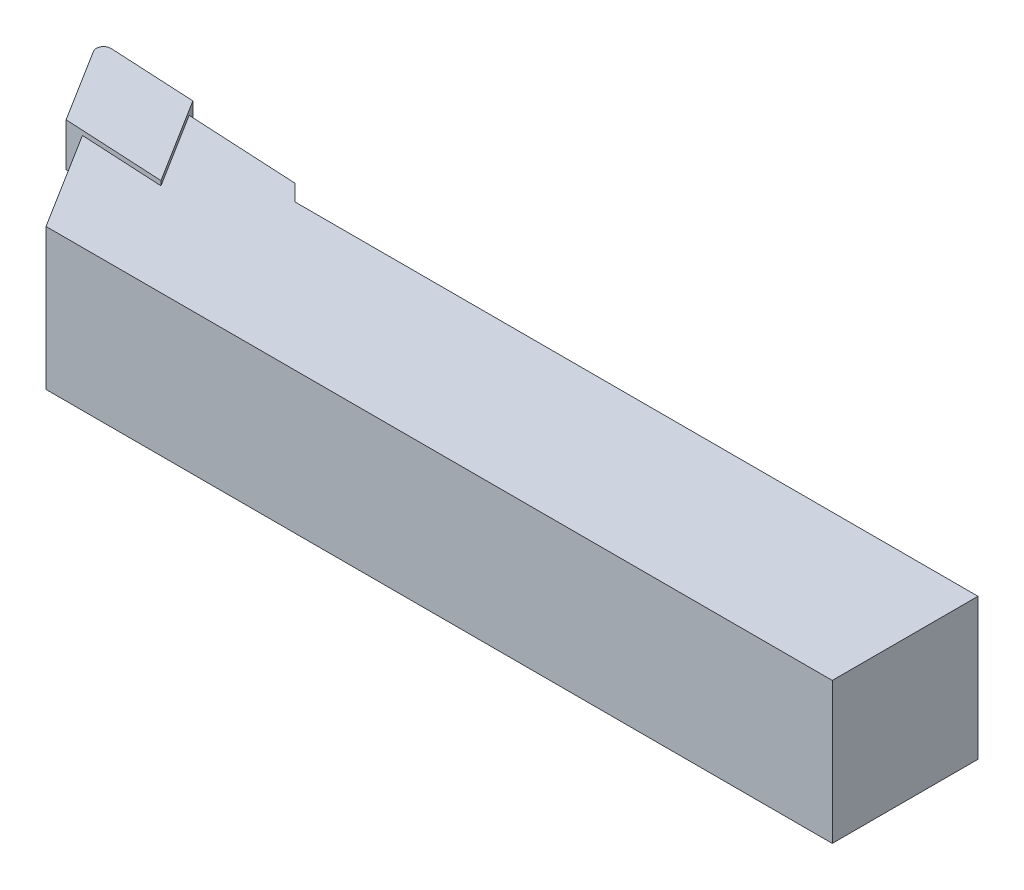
ISO-10303-21;
HEADER;
FILE_DESCRIPTION(('STEP AP214'),'2;1');
FILE_NAME('part.step','',(''),(''),'','','');
FILE_SCHEMA(('AUTOMOTIVE_DESIGN { 1 0 10303 214 1 1 1 1 }'));
ENDSEC;
DATA;
#1=APPLICATION_CONTEXT('core data for automotive mechanical design processes');
#2=APPLICATION_PROTOCOL_DEFINITION('international standard','automotive_design',2000,#1);
#3=PRODUCT_CONTEXT('',#1,'mechanical');
#4=PRODUCT('Part','Part','',(#3));
#5=PRODUCT_RELATED_PRODUCT_CATEGORY('part','',(#4));
#6=PRODUCT_DEFINITION_FORMATION('','',#4);
#7=PRODUCT_DEFINITION_CONTEXT('part definition',#1,'design');
#8=PRODUCT_DEFINITION('design','',#6,#7);
#9=PRODUCT_DEFINITION_SHAPE('','',#8);
#10=(LENGTH_UNIT() NAMED_UNIT(*) SI_UNIT(.MILLI.,.METRE.));
#11=(NAMED_UNIT(*) PLANE_ANGLE_UNIT() SI_UNIT($,.RADIAN.));
#12=(NAMED_UNIT(*) SI_UNIT($,.STERADIAN.) SOLID_ANGLE_UNIT());
#13=UNCERTAINTY_MEASURE_WITH_UNIT(LENGTH_MEASURE(1.E-05),#10,'distance_accuracy_value','');
#14=(GEOMETRIC_REPRESENTATION_CONTEXT(3) GLOBAL_UNCERTAINTY_ASSIGNED_CONTEXT((#13)) GLOBAL_UNIT_ASSIGNED_CONTEXT((#10,
#11,#12)) REPRESENTATION_CONTEXT('',''));
#15=CARTESIAN_POINT('',(0.,0.,0.));
#16=DIRECTION('',(0.,0.,1.));
#17=DIRECTION('',(1.,0.,0.));
#18=AXIS2_PLACEMENT_3D('',#15,#16,#17);
#19=CARTESIAN_POINT('',(5.13630108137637,-4.76,9.2491962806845));
#20=DIRECTION('',(-0.0523359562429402,0.,0.998629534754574));
#21=DIRECTION('',(0.998629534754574,0.,0.0523359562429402));
#22=AXIS2_PLACEMENT_3D('',#19,#20,#21);
#23=PLANE('',#22);
#24=DIRECTION('',(0.,-1.,0.));
#25=VECTOR('',#24,1.);
#26=CARTESIAN_POINT('',(7.02041880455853,-4.76,9.34793870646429));
#27=LINE('',#26,#25);
#28=CARTESIAN_POINT('',(7.02041880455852,-0.5,9.34793870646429));
#29=VERTEX_POINT('',#28);
#30=CARTESIAN_POINT('',(7.02041880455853,-4.76,9.34793870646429));
#31=VERTEX_POINT('',#30);
#32=EDGE_CURVE('E192',#29,#31,#27,.T.);
#33=ORIENTED_EDGE('',*,*,#32,.F.);
#34=DIRECTION('',(-0.998629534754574,0.,-0.0523359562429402));
#35=VECTOR('',#34,1.);
#36=CARTESIAN_POINT('',(5.13630108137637,-0.5,9.2491962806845));
#37=LINE('',#36,#35);
#38=CARTESIAN_POINT('',(16.1212259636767,-0.5,9.82489179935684));
#39=VERTEX_POINT('',#38);
#40=EDGE_CURVE('E194',#39,#29,#37,.T.);
#41=ORIENTED_EDGE('',*,*,#40,.F.);
#42=DIRECTION('',(0.,1.,0.));
#43=VECTOR('',#42,1.);
#44=CARTESIAN_POINT('',(16.1212259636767,-4.76,9.82489179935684));
#45=LINE('',#44,#43);
#46=CARTESIAN_POINT('',(16.1212259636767,0.,9.82489179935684));
#47=VERTEX_POINT('',#46);
#48=EDGE_CURVE('E209',#39,#47,#45,.T.);
#49=ORIENTED_EDGE('',*,*,#48,.T.);
#50=DIRECTION('',(0.998629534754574,0.,0.0523359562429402));
#51=VECTOR('',#50,1.);
#52=CARTESIAN_POINT('',(5.13630108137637,0.,9.2491962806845));
#53=LINE('',#52,#51);
#54=CARTESIAN_POINT('',(5.13630108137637,0.,9.2491962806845));
#55=VERTEX_POINT('',#54);
#56=EDGE_CURVE('E196',#55,#47,#53,.T.);
#57=ORIENTED_EDGE('',*,*,#56,.F.);
#58=DIRECTION('',(0.,1.,0.));
#59=VECTOR('',#58,1.);
#60=CARTESIAN_POINT('',(5.13630108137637,-4.76,9.2491962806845));
#61=LINE('',#60,#59);
#62=CARTESIAN_POINT('',(5.13630108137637,-4.76,9.2491962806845));
#63=VERTEX_POINT('',#62);
#64=EDGE_CURVE('E54',#63,#55,#61,.T.);
#65=ORIENTED_EDGE('',*,*,#64,.F.);
#66=DIRECTION('',(0.998629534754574,0.,0.0523359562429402));
#67=VECTOR('',#66,1.);
#68=CARTESIAN_POINT('',(5.13630108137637,-4.76,9.2491962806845));
#69=LINE('',#68,#67);
#70=EDGE_CURVE('E197',#63,#31,#69,.T.);
#71=ORIENTED_EDGE('',*,*,#70,.T.);
#72=EDGE_LOOP('',(#33,#41,#49,#57,#65,#71));
#73=FACE_BOUND('',#72,.T.);
#74=ADVANCED_FACE('F31',(#73),#23,.T.);
#75=CARTESIAN_POINT('',(0.12156152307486,-4.76,1.22393541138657));
#76=DIRECTION('',(-0.848048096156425,0.,0.529919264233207));
#77=DIRECTION('',(0.529919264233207,0.,0.848048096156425));
#78=AXIS2_PLACEMENT_3D('',#75,#76,#77);
#79=PLANE('',#78);
#80=DIRECTION('',(0.529919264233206,0.,0.848048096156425));
#81=VECTOR('',#80,1.);
#82=CARTESIAN_POINT('',(0.12156152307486,0.,1.22393541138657));
#83=LINE('',#82,#81);
#84=CARTESIAN_POINT('',(0.12156152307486,0.,1.22393541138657));
#85=VERTEX_POINT('',#84);
#86=EDGE_CURVE('E199',#85,#55,#83,.T.);
#87=ORIENTED_EDGE('',*,*,#86,.F.);
#88=DIRECTION('',(0.,1.,0.));
#89=VECTOR('',#88,1.);
#90=CARTESIAN_POINT('',(0.12156152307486,-4.76,1.22393541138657));
#91=LINE('',#90,#89);
#92=CARTESIAN_POINT('',(0.12156152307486,-4.76,1.22393541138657));
#93=VERTEX_POINT('',#92);
#94=EDGE_CURVE('E225',#93,#85,#91,.T.);
#95=ORIENTED_EDGE('',*,*,#94,.F.);
#96=DIRECTION('',(0.529919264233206,0.,0.848048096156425));
#97=VECTOR('',#96,1.);
#98=CARTESIAN_POINT('',(0.12156152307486,-4.76,1.22393541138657));
#99=LINE('',#98,#97);
#100=EDGE_CURVE('E207',#93,#63,#99,.T.);
#101=ORIENTED_EDGE('',*,*,#100,.T.);
#102=ORIENTED_EDGE('',*,*,#64,.T.);
#103=EDGE_LOOP('',(#87,#95,#101,#102));
#104=FACE_BOUND('',#103,.T.);
#105=ADVANCED_FACE('F254',(#104),#79,.T.);
#106=CARTESIAN_POINT('',(0.8,-4.76,0.8));
#107=DIRECTION('',(0.,1.,0.));
#108=DIRECTION('',(0.,0.,1.));
#109=AXIS2_PLACEMENT_3D('',#106,#107,#108);
#110=CYLINDRICAL_SURFACE('',#109,0.8);
#111=CARTESIAN_POINT('',(0.8,0.,0.8));
#112=DIRECTION('',(0.,1.,0.));
#113=DIRECTION('',(0.,0.,1.));
#114=AXIS2_PLACEMENT_3D('',#111,#112,#113);
#115=CIRCLE('',#114,0.8);
#116=CARTESIAN_POINT('',(0.841868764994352,0.,0.00109637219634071));
#117=VERTEX_POINT('',#116);
#118=EDGE_CURVE('E218',#117,#85,#115,.T.);
#119=ORIENTED_EDGE('',*,*,#118,.F.);
#120=DIRECTION('',(0.,1.,0.));
#121=VECTOR('',#120,1.);
#122=CARTESIAN_POINT('',(0.841868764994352,-4.76,0.00109637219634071));
#123=LINE('',#122,#121);
#124=CARTESIAN_POINT('',(0.841868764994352,-4.76,0.00109637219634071));
#125=VERTEX_POINT('',#124);
#126=EDGE_CURVE('E227',#125,#117,#123,.T.);
#127=ORIENTED_EDGE('',*,*,#126,.F.);
#128=CARTESIAN_POINT('',(0.8,-4.76,0.8));
#129=DIRECTION('',(0.,1.,0.));
#130=DIRECTION('',(0.,0.,1.));
#131=AXIS2_PLACEMENT_3D('',#128,#129,#130);
#132=CIRCLE('',#131,0.8);
#133=EDGE_CURVE('E204',#125,#93,#132,.T.);
#134=ORIENTED_EDGE('',*,*,#133,.T.);
#135=ORIENTED_EDGE('',*,*,#94,.T.);
#136=EDGE_LOOP('',(#119,#127,#134,#135));
#137=FACE_BOUND('',#136,.T.);
#138=ADVANCED_FACE('F257',(#137),#110,.T.);
#139=CARTESIAN_POINT('',(0.841868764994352,-4.76,0.0010963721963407));
#140=DIRECTION('',(0.0523359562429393,0.,-0.998629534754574));
#141=DIRECTION('',(-0.998629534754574,0.,-0.0523359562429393));
#142=AXIS2_PLACEMENT_3D('',#139,#140,#141);
#143=PLANE('',#142);
#144=DIRECTION('',(-0.998629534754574,0.,-0.0523359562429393));
#145=VECTOR('',#144,1.);
#146=CARTESIAN_POINT('',(0.841868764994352,0.,0.0010963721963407));
#147=LINE('',#146,#145);
#148=CARTESIAN_POINT('',(10.2921140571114,0.,0.496362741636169));
#149=VERTEX_POINT('',#148);
#150=EDGE_CURVE('E215',#149,#117,#147,.T.);
#151=ORIENTED_EDGE('',*,*,#150,.F.);
#152=DIRECTION('',(0.,1.,0.));
#153=VECTOR('',#152,1.);
#154=CARTESIAN_POINT('',(10.2921140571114,-4.76,0.496362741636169));
#155=LINE('',#154,#153);
#156=CARTESIAN_POINT('',(10.2921140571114,-4.76,0.496362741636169));
#157=VERTEX_POINT('',#156);
#158=EDGE_CURVE('E229',#157,#149,#155,.T.);
#159=ORIENTED_EDGE('',*,*,#158,.F.);
#160=DIRECTION('',(-0.998629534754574,0.,-0.0523359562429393));
#161=VECTOR('',#160,1.);
#162=CARTESIAN_POINT('',(0.841868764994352,-4.76,0.0010963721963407));
#163=LINE('',#162,#161);
#164=EDGE_CURVE('E201',#157,#125,#163,.T.);
#165=ORIENTED_EDGE('',*,*,#164,.T.);
#166=ORIENTED_EDGE('',*,*,#126,.T.);
#167=EDGE_LOOP('',(#151,#159,#165,#166));
#168=FACE_BOUND('',#167,.T.);
#169=ADVANCED_FACE('F261',(#168),#143,.T.);
#170=CARTESIAN_POINT('',(10.2921140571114,-4.76,0.496362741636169));
#171=DIRECTION('',(0.848048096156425,0.,-0.529919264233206));
#172=DIRECTION('',(-0.529919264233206,0.,-0.848048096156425));
#173=AXIS2_PLACEMENT_3D('',#170,#171,#172);
#174=PLANE('',#173);
#175=DIRECTION('',(0.,1.,0.));
#176=VECTOR('',#175,1.);
#177=CARTESIAN_POINT('',(10.9668206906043,-4.76,1.5761190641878));
#178=LINE('',#177,#176);
#179=CARTESIAN_POINT('',(10.9668206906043,-4.76,1.5761190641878));
#180=VERTEX_POINT('',#179);
#181=CARTESIAN_POINT('',(10.9668206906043,-0.5,1.5761190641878));
#182=VERTEX_POINT('',#181);
#183=EDGE_CURVE('E183',#180,#182,#178,.T.);
#184=ORIENTED_EDGE('',*,*,#183,.F.);
#185=DIRECTION('',(-0.529919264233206,0.,-0.848048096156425));
#186=VECTOR('',#185,1.);
#187=CARTESIAN_POINT('',(10.2921140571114,-4.76,0.496362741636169));
#188=LINE('',#187,#186);
#189=EDGE_CURVE('E83',#180,#157,#188,.T.);
#190=ORIENTED_EDGE('',*,*,#189,.T.);
#191=ORIENTED_EDGE('',*,*,#158,.T.);
#192=DIRECTION('',(-0.529919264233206,0.,-0.848048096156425));
#193=VECTOR('',#192,1.);
#194=CARTESIAN_POINT('',(10.2921140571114,0.,0.496362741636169));
#195=LINE('',#194,#193);
#196=EDGE_CURVE('E212',#47,#149,#195,.T.);
#197=ORIENTED_EDGE('',*,*,#196,.F.);
#198=ORIENTED_EDGE('',*,*,#48,.F.);
#199=DIRECTION('',(0.529919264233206,0.,0.848048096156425));
#200=VECTOR('',#199,1.);
#201=CARTESIAN_POINT('',(10.2921140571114,-0.5,0.496362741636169));
#202=LINE('',#201,#200);
#203=EDGE_CURVE('E11',#182,#39,#202,.T.);
#204=ORIENTED_EDGE('',*,*,#203,.F.);
#205=EDGE_LOOP('',(#184,#190,#191,#197,#198,#204));
#206=FACE_BOUND('',#205,.T.);
#207=ADVANCED_FACE('F249',(#206),#174,.T.);
#208=CARTESIAN_POINT('',(0.8,-4.76,0.8));
#209=DIRECTION('',(0.,1.,0.));
#210=DIRECTION('',(0.,0.,1.));
#211=AXIS2_PLACEMENT_3D('',#208,#209,#210);
#212=PLANE('',#211);
#213=DIRECTION('',(-0.998629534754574,0.,-0.0523359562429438));
#214=VECTOR('',#213,1.);
#215=CARTESIAN_POINT('',(0.787284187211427,-4.76,1.04263216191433));
#216=LINE('',#215,#214);
#217=CARTESIAN_POINT('',(1.86601353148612,-4.76,1.09916597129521));
#218=VERTEX_POINT('',#217);
#219=EDGE_CURVE('E224',#180,#218,#216,.T.);
#220=ORIENTED_EDGE('',*,*,#219,.T.);
#221=DIRECTION('',(0.529919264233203,0.,0.848048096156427));
#222=VECTOR('',#221,1.);
#223=CARTESIAN_POINT('',(1.43221725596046,-4.76,0.404946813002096));
#224=LINE('',#223,#222);
#225=EDGE_CURVE('E38',#218,#31,#224,.T.);
#226=ORIENTED_EDGE('',*,*,#225,.T.);
#227=ORIENTED_EDGE('',*,*,#70,.F.);
#228=ORIENTED_EDGE('',*,*,#100,.F.);
#229=ORIENTED_EDGE('',*,*,#133,.F.);
#230=ORIENTED_EDGE('',*,*,#164,.F.);
#231=ORIENTED_EDGE('',*,*,#189,.F.);
#232=EDGE_LOOP('',(#220,#226,#227,#228,#229,#230,#231));
#233=FACE_BOUND('',#232,.T.);
#234=ADVANCED_FACE('F235',(#233),#212,.F.);
#235=CARTESIAN_POINT('',(0.8,0.,0.8));
#236=DIRECTION('',(0.,1.,0.));
#237=DIRECTION('',(0.,0.,1.));
#238=AXIS2_PLACEMENT_3D('',#235,#236,#237);
#239=PLANE('',#238);
#240=ORIENTED_EDGE('',*,*,#56,.T.);
#241=ORIENTED_EDGE('',*,*,#196,.T.);
#242=ORIENTED_EDGE('',*,*,#150,.T.);
#243=ORIENTED_EDGE('',*,*,#118,.T.);
#244=ORIENTED_EDGE('',*,*,#86,.T.);
#245=EDGE_LOOP('',(#240,#241,#242,#243,#244));
#246=FACE_BOUND('',#245,.T.);
#247=ADVANCED_FACE('F252',(#246),#239,.T.);
#248=CARTESIAN_POINT('',(100.,-16.,4.));
#249=DIRECTION('',(0.,0.,-1.));
#250=DIRECTION('',(-1.,0.,0.));
#251=AXIS2_PLACEMENT_3D('',#248,#249,#250);
#252=PLANE('',#251);
#253=DIRECTION('',(-1.,0.,0.));
#254=VECTOR('',#253,1.);
#255=CARTESIAN_POINT('',(100.,-0.5,4.));
#256=LINE('',#255,#254);
#257=CARTESIAN_POINT('',(100.,-0.5,4.));
#258=VERTEX_POINT('',#257);
#259=CARTESIAN_POINT('',(25.,-0.5,4.));
#260=VERTEX_POINT('',#259);
#261=EDGE_CURVE('E172',#258,#260,#256,.T.);
#262=ORIENTED_EDGE('',*,*,#261,.F.);
#263=DIRECTION('',(0.,1.,0.));
#264=VECTOR('',#263,1.);
#265=CARTESIAN_POINT('',(100.,-16.,4.));
#266=LINE('',#265,#264);
#267=CARTESIAN_POINT('',(100.,-16.,4.));
#268=VERTEX_POINT('',#267);
#269=EDGE_CURVE('E157',#268,#258,#266,.T.);
#270=ORIENTED_EDGE('',*,*,#269,.F.);
#271=DIRECTION('',(-1.,0.,0.));
#272=VECTOR('',#271,1.);
#273=CARTESIAN_POINT('',(100.,-16.,4.));
#274=LINE('',#273,#272);
#275=CARTESIAN_POINT('',(25.,-16.,4.));
#276=VERTEX_POINT('',#275);
#277=EDGE_CURVE('E151',#268,#276,#274,.T.);
#278=ORIENTED_EDGE('',*,*,#277,.T.);
#279=DIRECTION('',(0.,1.,0.));
#280=VECTOR('',#279,1.);
#281=CARTESIAN_POINT('',(25.,-16.,4.));
#282=LINE('',#281,#280);
#283=EDGE_CURVE('E133',#276,#260,#282,.T.);
#284=ORIENTED_EDGE('',*,*,#283,.T.);
#285=EDGE_LOOP('',(#262,#270,#278,#284));
#286=FACE_BOUND('',#285,.T.);
#287=ADVANCED_FACE('F156',(#286),#252,.T.);
#288=CARTESIAN_POINT('',(100.,-16.,4.));
#289=DIRECTION('',(1.,0.,0.));
#290=DIRECTION('',(0.,0.,-1.));
#291=AXIS2_PLACEMENT_3D('',#288,#289,#290);
#292=PLANE('',#291);
#293=DIRECTION('',(0.,0.,-1.));
#294=VECTOR('',#293,1.);
#295=CARTESIAN_POINT('',(100.,-0.5,4.));
#296=LINE('',#295,#294);
#297=CARTESIAN_POINT('',(100.,-0.5,20.));
#298=VERTEX_POINT('',#297);
#299=EDGE_CURVE('E158',#298,#258,#296,.T.);
#300=ORIENTED_EDGE('',*,*,#299,.F.);
#301=DIRECTION('',(0.,1.,0.));
#302=VECTOR('',#301,1.);
#303=CARTESIAN_POINT('',(100.,-16.,20.));
#304=LINE('',#303,#302);
#305=CARTESIAN_POINT('',(100.,-16.,20.));
#306=VERTEX_POINT('',#305);
#307=EDGE_CURVE('E184',#306,#298,#304,.T.);
#308=ORIENTED_EDGE('',*,*,#307,.F.);
#309=DIRECTION('',(0.,0.,-1.));
#310=VECTOR('',#309,1.);
#311=CARTESIAN_POINT('',(100.,-16.,4.));
#312=LINE('',#311,#310);
#313=EDGE_CURVE('E144',#306,#268,#312,.T.);
#314=ORIENTED_EDGE('',*,*,#313,.T.);
#315=ORIENTED_EDGE('',*,*,#269,.T.);
#316=EDGE_LOOP('',(#300,#308,#314,#315));
#317=FACE_BOUND('',#316,.T.);
#318=ADVANCED_FACE('F283',(#317),#292,.T.);
#319=CARTESIAN_POINT('',(100.,-16.,20.));
#320=DIRECTION('',(0.,0.,1.));
#321=DIRECTION('',(1.,0.,0.));
#322=AXIS2_PLACEMENT_3D('',#319,#320,#321);
#323=PLANE('',#322);
#324=DIRECTION('',(1.,0.,0.));
#325=VECTOR('',#324,1.);
#326=CARTESIAN_POINT('',(100.,-0.5,20.));
#327=LINE('',#326,#325);
#328=CARTESIAN_POINT('',(13.6765654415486,-0.5,20.));
#329=VERTEX_POINT('',#328);
#330=EDGE_CURVE('E161',#329,#298,#327,.T.);
#331=ORIENTED_EDGE('',*,*,#330,.F.);
#332=DIRECTION('',(0.,1.,0.));
#333=VECTOR('',#332,1.);
#334=CARTESIAN_POINT('',(13.6765654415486,-16.,20.));
#335=LINE('',#334,#333);
#336=CARTESIAN_POINT('',(13.6765654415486,-16.,20.));
#337=VERTEX_POINT('',#336);
#338=EDGE_CURVE('E186',#337,#329,#335,.T.);
#339=ORIENTED_EDGE('',*,*,#338,.F.);
#340=DIRECTION('',(1.,0.,0.));
#341=VECTOR('',#340,1.);
#342=CARTESIAN_POINT('',(100.,-16.,20.));
#343=LINE('',#342,#341);
#344=EDGE_CURVE('E168',#337,#306,#343,.T.);
#345=ORIENTED_EDGE('',*,*,#344,.T.);
#346=ORIENTED_EDGE('',*,*,#307,.T.);
#347=EDGE_LOOP('',(#331,#339,#345,#346));
#348=FACE_BOUND('',#347,.T.);
#349=ADVANCED_FACE('F291',(#348),#323,.T.);
#350=CARTESIAN_POINT('',(1.86601353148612,-16.,1.09916597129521));
#351=DIRECTION('',(-0.848048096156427,0.,0.529919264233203));
#352=DIRECTION('',(0.529919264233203,0.,0.848048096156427));
#353=AXIS2_PLACEMENT_3D('',#350,#351,#352);
#354=PLANE('',#353);
#355=DIRECTION('',(0.529919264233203,0.,0.848048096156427));
#356=VECTOR('',#355,1.);
#357=CARTESIAN_POINT('',(1.86601353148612,-0.5,1.09916597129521));
#358=LINE('',#357,#356);
#359=EDGE_CURVE('E178',#29,#329,#358,.T.);
#360=ORIENTED_EDGE('',*,*,#359,.F.);
#361=ORIENTED_EDGE('',*,*,#32,.T.);
#362=ORIENTED_EDGE('',*,*,#225,.F.);
#363=DIRECTION('',(0.,1.,0.));
#364=VECTOR('',#363,1.);
#365=CARTESIAN_POINT('',(1.86601353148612,-16.,1.09916597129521));
#366=LINE('',#365,#364);
#367=CARTESIAN_POINT('',(1.86601353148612,-16.,1.09916597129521));
#368=VERTEX_POINT('',#367);
#369=EDGE_CURVE('E45',#368,#218,#366,.T.);
#370=ORIENTED_EDGE('',*,*,#369,.F.);
#371=DIRECTION('',(0.529919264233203,0.,0.848048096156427));
#372=VECTOR('',#371,1.);
#373=CARTESIAN_POINT('',(1.86601353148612,-16.,1.09916597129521));
#374=LINE('',#373,#372);
#375=EDGE_CURVE('E165',#368,#337,#374,.T.);
#376=ORIENTED_EDGE('',*,*,#375,.T.);
#377=ORIENTED_EDGE('',*,*,#338,.T.);
#378=EDGE_LOOP('',(#360,#361,#362,#370,#376,#377));
#379=FACE_BOUND('',#378,.T.);
#380=ADVANCED_FACE('F242',(#379),#354,.T.);
#381=CARTESIAN_POINT('',(1.86601353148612,-16.,1.09916597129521));
#382=DIRECTION('',(0.0523359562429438,0.,-0.998629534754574));
#383=DIRECTION('',(-0.998629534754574,0.,-0.0523359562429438));
#384=AXIS2_PLACEMENT_3D('',#381,#382,#383);
#385=PLANE('',#384);
#386=ORIENTED_EDGE('',*,*,#219,.F.);
#387=ORIENTED_EDGE('',*,*,#183,.T.);
#388=DIRECTION('',(-0.998629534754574,0.,-0.0523359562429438));
#389=VECTOR('',#388,1.);
#390=CARTESIAN_POINT('',(1.86601353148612,-0.5,1.09916597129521));
#391=LINE('',#390,#389);
#392=CARTESIAN_POINT('',(23.2181859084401,-0.5,2.21818590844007));
#393=VERTEX_POINT('',#392);
#394=EDGE_CURVE('E175',#393,#182,#391,.T.);
#395=ORIENTED_EDGE('',*,*,#394,.F.);
#396=DIRECTION('',(0.,1.,0.));
#397=VECTOR('',#396,1.);
#398=CARTESIAN_POINT('',(23.2181859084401,-16.,2.21818590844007));
#399=LINE('',#398,#397);
#400=CARTESIAN_POINT('',(23.2181859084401,-16.,2.21818590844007));
#401=VERTEX_POINT('',#400);
#402=EDGE_CURVE('E143',#401,#393,#399,.T.);
#403=ORIENTED_EDGE('',*,*,#402,.F.);
#404=DIRECTION('',(-0.998629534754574,0.,-0.0523359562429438));
#405=VECTOR('',#404,1.);
#406=CARTESIAN_POINT('',(1.86601353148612,-16.,1.09916597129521));
#407=LINE('',#406,#405);
#408=EDGE_CURVE('E154',#401,#368,#407,.T.);
#409=ORIENTED_EDGE('',*,*,#408,.T.);
#410=ORIENTED_EDGE('',*,*,#369,.T.);
#411=EDGE_LOOP('',(#386,#387,#395,#403,#409,#410));
#412=FACE_BOUND('',#411,.T.);
#413=ADVANCED_FACE('F286',(#412),#385,.T.);
#414=CARTESIAN_POINT('',(25.,-16.,4.));
#415=DIRECTION('',(0.707106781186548,0.,-0.707106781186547));
#416=DIRECTION('',(-0.707106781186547,0.,-0.707106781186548));
#417=AXIS2_PLACEMENT_3D('',#414,#415,#416);
#418=PLANE('',#417);
#419=DIRECTION('',(-0.707106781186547,0.,-0.707106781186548));
#420=VECTOR('',#419,1.);
#421=CARTESIAN_POINT('',(25.,-0.5,4.));
#422=LINE('',#421,#420);
#423=EDGE_CURVE('E138',#260,#393,#422,.T.);
#424=ORIENTED_EDGE('',*,*,#423,.F.);
#425=ORIENTED_EDGE('',*,*,#283,.F.);
#426=DIRECTION('',(-0.707106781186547,0.,-0.707106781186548));
#427=VECTOR('',#426,1.);
#428=CARTESIAN_POINT('',(25.,-16.,4.));
#429=LINE('',#428,#427);
#430=EDGE_CURVE('E136',#276,#401,#429,.T.);
#431=ORIENTED_EDGE('',*,*,#430,.T.);
#432=ORIENTED_EDGE('',*,*,#402,.T.);
#433=EDGE_LOOP('',(#424,#425,#431,#432));
#434=FACE_BOUND('',#433,.T.);
#435=ADVANCED_FACE('F135',(#434),#418,.T.);
#436=CARTESIAN_POINT('',(100.,-16.,4.));
#437=DIRECTION('',(0.,1.,0.));
#438=DIRECTION('',(0.,0.,1.));
#439=AXIS2_PLACEMENT_3D('',#436,#437,#438);
#440=PLANE('',#439);
#441=ORIENTED_EDGE('',*,*,#277,.F.);
#442=ORIENTED_EDGE('',*,*,#313,.F.);
#443=ORIENTED_EDGE('',*,*,#344,.F.);
#444=ORIENTED_EDGE('',*,*,#375,.F.);
#445=ORIENTED_EDGE('',*,*,#408,.F.);
#446=ORIENTED_EDGE('',*,*,#430,.F.);
#447=EDGE_LOOP('',(#441,#442,#443,#444,#445,#446));
#448=FACE_BOUND('',#447,.T.);
#449=ADVANCED_FACE('F149',(#448),#440,.F.);
#450=CARTESIAN_POINT('',(100.,-0.5,4.));
#451=DIRECTION('',(0.,1.,0.));
#452=DIRECTION('',(0.,0.,1.));
#453=AXIS2_PLACEMENT_3D('',#450,#451,#452);
#454=PLANE('',#453);
#455=ORIENTED_EDGE('',*,*,#203,.T.);
#456=ORIENTED_EDGE('',*,*,#40,.T.);
#457=ORIENTED_EDGE('',*,*,#359,.T.);
#458=ORIENTED_EDGE('',*,*,#330,.T.);
#459=ORIENTED_EDGE('',*,*,#299,.T.);
#460=ORIENTED_EDGE('',*,*,#261,.T.);
#461=ORIENTED_EDGE('',*,*,#423,.T.);
#462=ORIENTED_EDGE('',*,*,#394,.T.);
#463=EDGE_LOOP('',(#455,#456,#457,#458,#459,#460,#461,#462));
#464=FACE_BOUND('',#463,.T.);
#465=ADVANCED_FACE('F245',(#464),#454,.T.);
#466=CLOSED_SHELL('',(#74,#105,#138,#169,#207,#234,#247,#287,#318,#349,#380,#413,#435,#449,#465));
#467=MANIFOLD_SOLID_BREP('B2',#466);
#468=ADVANCED_BREP_SHAPE_REPRESENTATION('',(#18,#467),#14);
#469=SHAPE_DEFINITION_REPRESENTATION(#9,#468);
ENDSEC;
END-ISO-10303-21;
